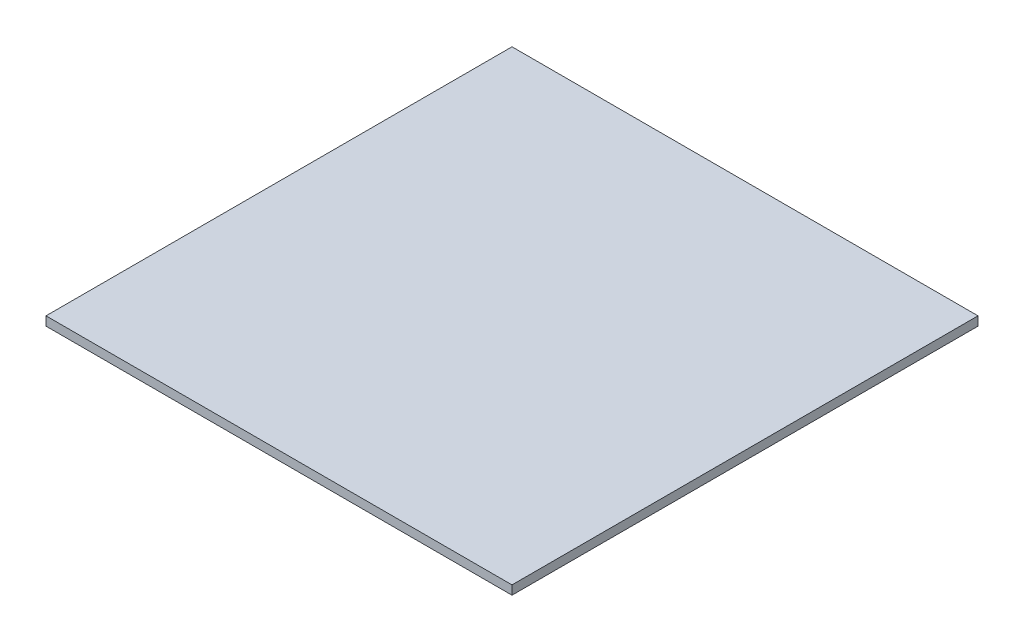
ISO-10303-21;
HEADER;
FILE_DESCRIPTION(('STEP AP214'),'2;1');
FILE_NAME('part.step','',(''),(''),'','','');
FILE_SCHEMA(('AUTOMOTIVE_DESIGN { 1 0 10303 214 1 1 1 1 }'));
ENDSEC;
DATA;
#1=APPLICATION_CONTEXT('core data for automotive mechanical design processes');
#2=APPLICATION_PROTOCOL_DEFINITION('international standard','automotive_design',2000,#1);
#3=PRODUCT_CONTEXT('',#1,'mechanical');
#4=PRODUCT('Part','Part','',(#3));
#5=PRODUCT_RELATED_PRODUCT_CATEGORY('part','',(#4));
#6=PRODUCT_DEFINITION_FORMATION('','',#4);
#7=PRODUCT_DEFINITION_CONTEXT('part definition',#1,'design');
#8=PRODUCT_DEFINITION('design','',#6,#7);
#9=PRODUCT_DEFINITION_SHAPE('','',#8);
#10=(LENGTH_UNIT() NAMED_UNIT(*) SI_UNIT(.MILLI.,.METRE.));
#11=(NAMED_UNIT(*) PLANE_ANGLE_UNIT() SI_UNIT($,.RADIAN.));
#12=(NAMED_UNIT(*) SI_UNIT($,.STERADIAN.) SOLID_ANGLE_UNIT());
#13=UNCERTAINTY_MEASURE_WITH_UNIT(LENGTH_MEASURE(1.E-05),#10,'distance_accuracy_value','');
#14=(GEOMETRIC_REPRESENTATION_CONTEXT(3) GLOBAL_UNCERTAINTY_ASSIGNED_CONTEXT((#13)) GLOBAL_UNIT_ASSIGNED_CONTEXT((#10,
#11,#12)) REPRESENTATION_CONTEXT('',''));
#15=CARTESIAN_POINT('',(0.,0.,0.));
#16=DIRECTION('',(0.,0.,1.));
#17=DIRECTION('',(1.,0.,0.));
#18=AXIS2_PLACEMENT_3D('',#15,#16,#17);
#19=CARTESIAN_POINT('',(165.1,6.35,165.1));
#20=DIRECTION('',(0.,0.,1.));
#21=DIRECTION('',(1.,0.,0.));
#22=AXIS2_PLACEMENT_3D('',#19,#20,#21);
#23=PLANE('',#22);
#24=DIRECTION('',(-1.,0.,0.));
#25=VECTOR('',#24,1.);
#26=CARTESIAN_POINT('',(165.1,0.,165.1));
#27=LINE('',#26,#25);
#28=CARTESIAN_POINT('',(165.1,0.,165.1));
#29=VERTEX_POINT('',#28);
#30=CARTESIAN_POINT('',(-165.1,0.,165.1));
#31=VERTEX_POINT('',#30);
#32=EDGE_CURVE('E98',#29,#31,#27,.T.);
#33=ORIENTED_EDGE('',*,*,#32,.F.);
#34=DIRECTION('',(0.,-1.,0.));
#35=VECTOR('',#34,1.);
#36=CARTESIAN_POINT('',(165.1,6.35,165.1));
#37=LINE('',#36,#35);
#38=CARTESIAN_POINT('',(165.1,6.35,165.1));
#39=VERTEX_POINT('',#38);
#40=EDGE_CURVE('E11',#39,#29,#37,.T.);
#41=ORIENTED_EDGE('',*,*,#40,.F.);
#42=DIRECTION('',(-1.,0.,0.));
#43=VECTOR('',#42,1.);
#44=CARTESIAN_POINT('',(165.1,6.35,165.1));
#45=LINE('',#44,#43);
#46=CARTESIAN_POINT('',(-165.1,6.35,165.1));
#47=VERTEX_POINT('',#46);
#48=EDGE_CURVE('E93',#39,#47,#45,.T.);
#49=ORIENTED_EDGE('',*,*,#48,.T.);
#50=DIRECTION('',(0.,-1.,0.));
#51=VECTOR('',#50,1.);
#52=CARTESIAN_POINT('',(-165.1,6.35,165.1));
#53=LINE('',#52,#51);
#54=EDGE_CURVE('E36',#47,#31,#53,.T.);
#55=ORIENTED_EDGE('',*,*,#54,.T.);
#56=EDGE_LOOP('',(#33,#41,#49,#55));
#57=FACE_BOUND('',#56,.T.);
#58=ADVANCED_FACE('F33',(#57),#23,.T.);
#59=CARTESIAN_POINT('',(165.1,6.35,165.1));
#60=DIRECTION('',(-1.,0.,0.));
#61=DIRECTION('',(0.,0.,1.));
#62=AXIS2_PLACEMENT_3D('',#59,#60,#61);
#63=PLANE('',#62);
#64=DIRECTION('',(0.,0.,-1.));
#65=VECTOR('',#64,1.);
#66=CARTESIAN_POINT('',(165.1,0.,165.1));
#67=LINE('',#66,#65);
#68=CARTESIAN_POINT('',(165.1,0.,-165.1));
#69=VERTEX_POINT('',#68);
#70=EDGE_CURVE('E66',#29,#69,#67,.T.);
#71=ORIENTED_EDGE('',*,*,#70,.T.);
#72=DIRECTION('',(0.,-1.,0.));
#73=VECTOR('',#72,1.);
#74=CARTESIAN_POINT('',(165.1,6.35,-165.1));
#75=LINE('',#74,#73);
#76=CARTESIAN_POINT('',(165.1,6.35,-165.1));
#77=VERTEX_POINT('',#76);
#78=EDGE_CURVE('E42',#77,#69,#75,.T.);
#79=ORIENTED_EDGE('',*,*,#78,.F.);
#80=DIRECTION('',(0.,0.,-1.));
#81=VECTOR('',#80,1.);
#82=CARTESIAN_POINT('',(165.1,6.35,165.1));
#83=LINE('',#82,#81);
#84=EDGE_CURVE('E83',#39,#77,#83,.T.);
#85=ORIENTED_EDGE('',*,*,#84,.F.);
#86=ORIENTED_EDGE('',*,*,#40,.T.);
#87=EDGE_LOOP('',(#71,#79,#85,#86));
#88=FACE_BOUND('',#87,.T.);
#89=ADVANCED_FACE('F108',(#88),#63,.F.);
#90=CARTESIAN_POINT('',(165.1,6.35,-165.1));
#91=DIRECTION('',(0.,0.,1.));
#92=DIRECTION('',(1.,0.,0.));
#93=AXIS2_PLACEMENT_3D('',#90,#91,#92);
#94=PLANE('',#93);
#95=DIRECTION('',(-1.,0.,0.));
#96=VECTOR('',#95,1.);
#97=CARTESIAN_POINT('',(165.1,0.,-165.1));
#98=LINE('',#97,#96);
#99=CARTESIAN_POINT('',(-165.1,0.,-165.1));
#100=VERTEX_POINT('',#99);
#101=EDGE_CURVE('E90',#69,#100,#98,.T.);
#102=ORIENTED_EDGE('',*,*,#101,.T.);
#103=DIRECTION('',(0.,-1.,0.));
#104=VECTOR('',#103,1.);
#105=CARTESIAN_POINT('',(-165.1,6.35,-165.1));
#106=LINE('',#105,#104);
#107=CARTESIAN_POINT('',(-165.1,6.35,-165.1));
#108=VERTEX_POINT('',#107);
#109=EDGE_CURVE('E87',#108,#100,#106,.T.);
#110=ORIENTED_EDGE('',*,*,#109,.F.);
#111=DIRECTION('',(-1.,0.,0.));
#112=VECTOR('',#111,1.);
#113=CARTESIAN_POINT('',(165.1,6.35,-165.1));
#114=LINE('',#113,#112);
#115=EDGE_CURVE('E78',#77,#108,#114,.T.);
#116=ORIENTED_EDGE('',*,*,#115,.F.);
#117=ORIENTED_EDGE('',*,*,#78,.T.);
#118=EDGE_LOOP('',(#102,#110,#116,#117));
#119=FACE_BOUND('',#118,.T.);
#120=ADVANCED_FACE('F88',(#119),#94,.F.);
#121=CARTESIAN_POINT('',(-165.1,6.35,165.1));
#122=DIRECTION('',(-1.,0.,0.));
#123=DIRECTION('',(0.,0.,1.));
#124=AXIS2_PLACEMENT_3D('',#121,#122,#123);
#125=PLANE('',#124);
#126=DIRECTION('',(0.,0.,-1.));
#127=VECTOR('',#126,1.);
#128=CARTESIAN_POINT('',(-165.1,0.,165.1));
#129=LINE('',#128,#127);
#130=EDGE_CURVE('E101',#31,#100,#129,.T.);
#131=ORIENTED_EDGE('',*,*,#130,.F.);
#132=ORIENTED_EDGE('',*,*,#54,.F.);
#133=DIRECTION('',(0.,0.,-1.));
#134=VECTOR('',#133,1.);
#135=CARTESIAN_POINT('',(-165.1,6.35,165.1));
#136=LINE('',#135,#134);
#137=EDGE_CURVE('E82',#47,#108,#136,.T.);
#138=ORIENTED_EDGE('',*,*,#137,.T.);
#139=ORIENTED_EDGE('',*,*,#109,.T.);
#140=EDGE_LOOP('',(#131,#132,#138,#139));
#141=FACE_BOUND('',#140,.T.);
#142=ADVANCED_FACE('F92',(#141),#125,.T.);
#143=CARTESIAN_POINT('',(0.,6.35,0.));
#144=DIRECTION('',(0.,-1.,0.));
#145=DIRECTION('',(0.,0.,-1.));
#146=AXIS2_PLACEMENT_3D('',#143,#144,#145);
#147=PLANE('',#146);
#148=ORIENTED_EDGE('',*,*,#48,.F.);
#149=ORIENTED_EDGE('',*,*,#84,.T.);
#150=ORIENTED_EDGE('',*,*,#115,.T.);
#151=ORIENTED_EDGE('',*,*,#137,.F.);
#152=EDGE_LOOP('',(#148,#149,#150,#151));
#153=FACE_BOUND('',#152,.T.);
#154=ADVANCED_FACE('F81',(#153),#147,.F.);
#155=CARTESIAN_POINT('',(0.,0.,0.));
#156=DIRECTION('',(0.,-1.,0.));
#157=DIRECTION('',(0.,0.,-1.));
#158=AXIS2_PLACEMENT_3D('',#155,#156,#157);
#159=PLANE('',#158);
#160=ORIENTED_EDGE('',*,*,#32,.T.);
#161=ORIENTED_EDGE('',*,*,#130,.T.);
#162=ORIENTED_EDGE('',*,*,#101,.F.);
#163=ORIENTED_EDGE('',*,*,#70,.F.);
#164=EDGE_LOOP('',(#160,#161,#162,#163));
#165=FACE_BOUND('',#164,.T.);
#166=ADVANCED_FACE('F106',(#165),#159,.T.);
#167=CLOSED_SHELL('',(#58,#89,#120,#142,#154,#166));
#168=MANIFOLD_SOLID_BREP('B2',#167);
#169=ADVANCED_BREP_SHAPE_REPRESENTATION('',(#18,#168),#14);
#170=SHAPE_DEFINITION_REPRESENTATION(#9,#169);
ENDSEC;
END-ISO-10303-21;
